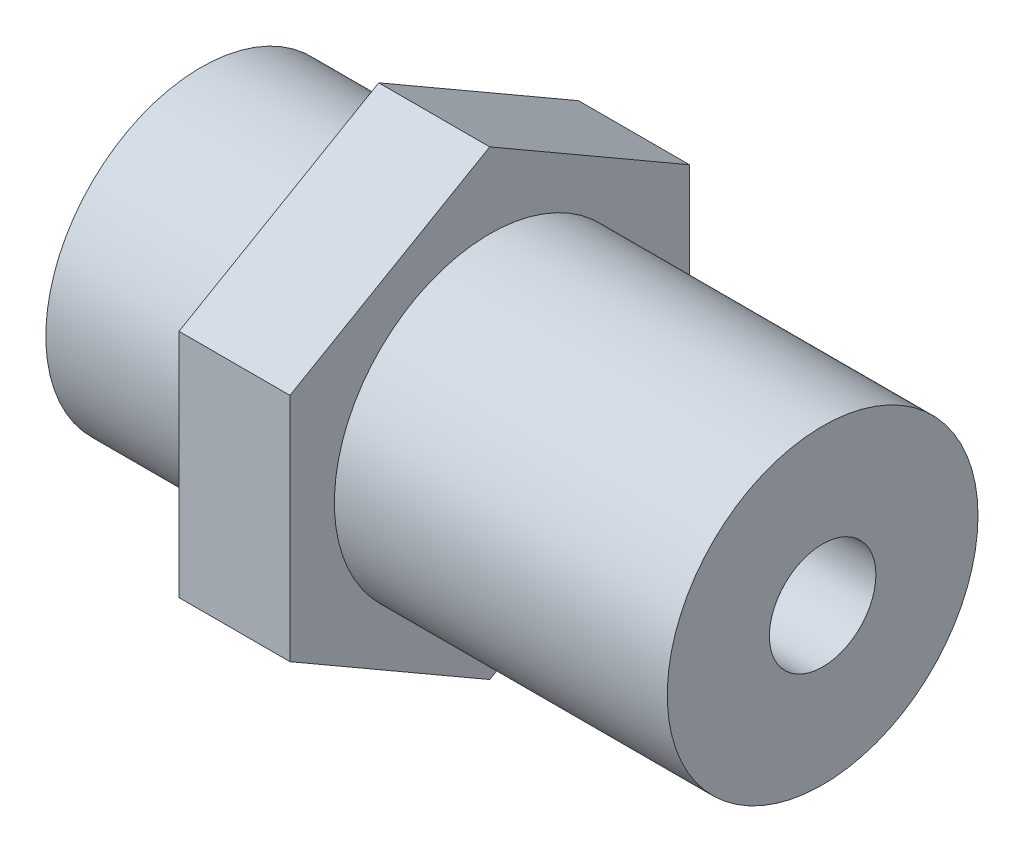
from build123d import *

# Parameters (mm, degrees)
BARRIL_START       = 2
SK_BARRIL_R        = 3.5
SK_BARRIL_R_2      = 1.2
BARRIL_DEPTH       = 14
CONTRATUERCA_START = 2.5
SK_CONTRATUERCA_R  = 1.2
CONTRATUERCA_DEPTH = 2.5


with BuildPart() as part:
    # Sk_barril → Barril (new body)
    with BuildSketch(Plane(origin=(-32, 0, 0), x_dir=(0, 0, -1), z_dir=(1, 0, 0)).offset(BARRIL_START)):
        with Locations((-60.4, -16)):
            Circle(SK_BARRIL_R)
        with Locations((-60.4, -16)):
            Circle(SK_BARRIL_R_2, mode=Mode.SUBTRACT)
    extrude(amount=-BARRIL_DEPTH)

    # Sk_contratuerca → Contratuerca (add)
    with BuildSketch(Plane(origin=(-40, 0, 0), x_dir=(0, 0, -1), z_dir=(1, 0, 0)).offset(CONTRATUERCA_START)):
        Polygon((-60.4, -10.803847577), (-64.9, -13.401923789), (-64.9, -18.598076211), (-60.4, -21.196152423), (-55.9, -18.598076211), (-55.9, -13.401923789), align=None)
        with Locations((-60.4, -16)):
            Circle(SK_CONTRATUERCA_R, mode=Mode.SUBTRACT)
    extrude(amount=-CONTRATUERCA_DEPTH)


solid = part.part
